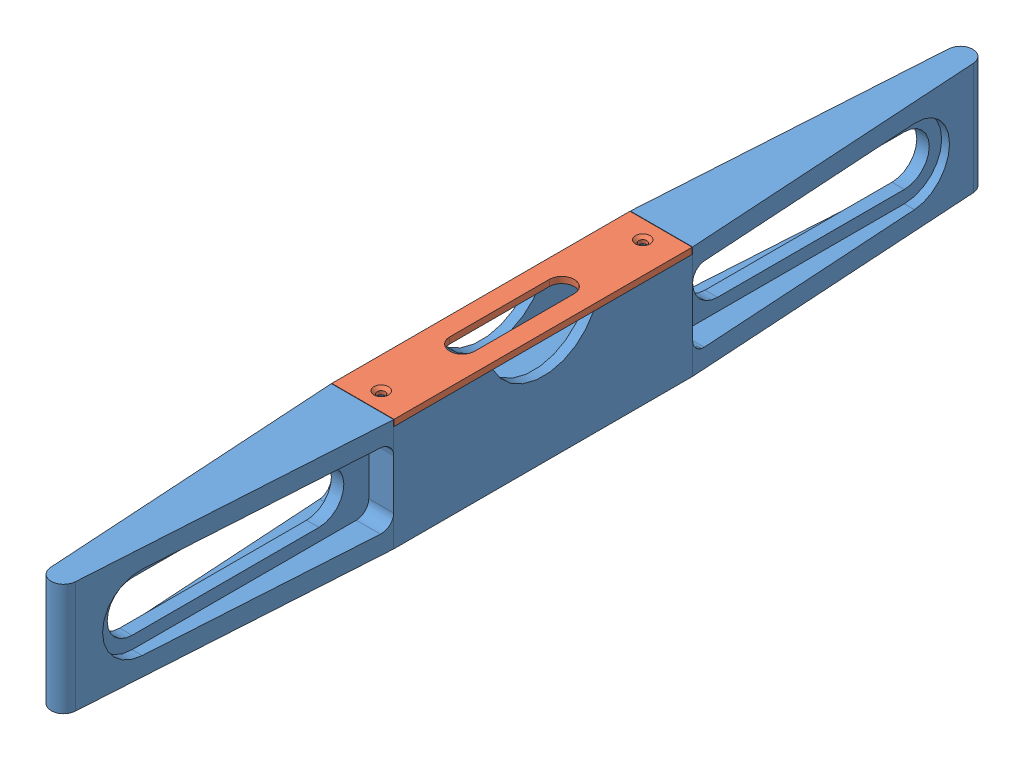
SolidWorks assembly Level Assembly.SLDASM, configuration Default (file format 5800). Lengths in mm.
Overall size (15.88 28.57 234.95).
2 component instances, 2 part files, 4 mates.
Components (placement in the parent):
- LEVEL-1: LEVEL.SLDPRT [Default] at origin size (15.88 28.57 234.95)
- Top Cover-1: Top Cover.SLDPRT [Default] at (0 26.9875 0) x (-1 0 0) z (0 1 0) size (15.88 76 1.59)
Mates (geometry in assembly coordinates):
- Inplace1: in place: plane of LEVEL-1; plane of Top Cover-1; moOrthogonalPlaneRef_w of LEVEL-1; plane of Top Cover-1; moOrthogonalPlaneRef_w of LEVEL-1; plane of Top Cover-1
- Coincident1: coincident aligned: plane of LEVEL-1; plane of Top Cover-1
- Coincident2: coincident aligned: moOrthogonalPlaneRef_w of LEVEL-1; plane of Top Cover-1
- Coincident3: coincident anti-aligned: moOrthogonalPlaneRef_w of LEVEL-1; plane of Top Cover-1
